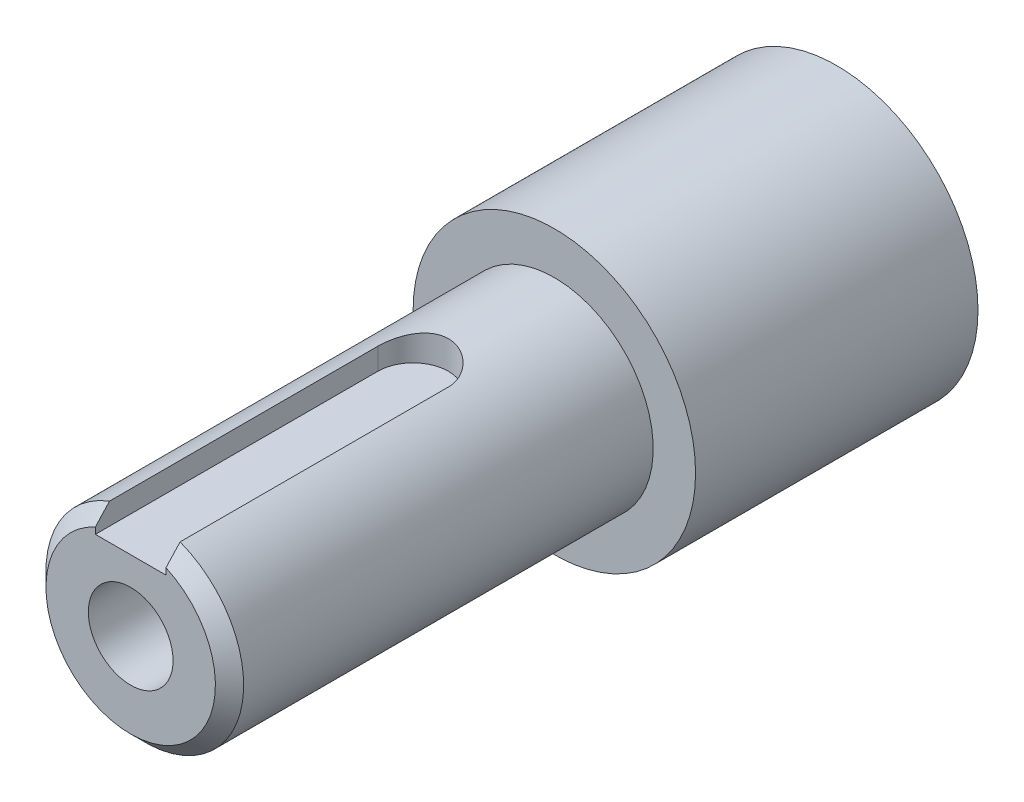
from build123d import *

# Parameters (mm, degrees)
ESQUISSE1_R                     = 7
EXTRUSION1_DEPTH                = 44
CHANFREIN1_SIZE                 = 1
ENL_V_MAT_EXTRU_1_DEPTH         = 2
TROU_TARAUD_M6X1_01_D           = 5
TROU_TARAUD_M6X1_01_DEPTH       = 25
TROU_TARAUD_M6X1_01_CBORE_D     = 6
TROU_TARAUD_M6X1_01_CBORE_DEPTH = 22
TROU_TARAUD_M6X1_01_TIP         = 1.502151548
EXTRUSION2_START                = -14
ESQUISSE7_R                     = 10
EXTRUSION2_DEPTH                = 20


with BuildPart() as part:
    # Esquisse1 → Extrusion1 (new body)
    with BuildSketch(Plane.XY):
        Circle(ESQUISSE1_R)
    extrude(amount=-EXTRUSION1_DEPTH)

    # Chanfrein1
    chanfrein1_edges = [part.edges().sort_by_distance(p)[0] for p in [
        (-7, 0, 0),
    ]]
    chamfer(chanfrein1_edges, length=CHANFREIN1_SIZE)

    # Esquisse3 → Enl_v. mat.-Extru.1 (cut)
    with BuildSketch(Plane(origin=(0, 7, 0), x_dir=(-1, 0, 0), z_dir=(0, 1, 0))):
        with BuildLine():
            Line((2.5, 0), (2.5, -20))
            ThreePointArc((2.5, -20), (0, -22.5), (-2.5, -20))
            Line((-2.5, -20), (-2.5, 0))
            Line((-2.5, 0), (2.5, 0))
        make_face()
    extrude(amount=-ENL_V_MAT_EXTRU_1_DEPTH, mode=Mode.SUBTRACT)

    # Trou taraud_ M6x1.01
    with Locations(Plane.XY):
        with Locations((0, 0)):
            CounterBoreHole(TROU_TARAUD_M6X1_01_D / 2, TROU_TARAUD_M6X1_01_CBORE_D / 2, TROU_TARAUD_M6X1_01_CBORE_DEPTH, depth=TROU_TARAUD_M6X1_01_DEPTH)
            with Locations((0, 0, -(TROU_TARAUD_M6X1_01_DEPTH + TROU_TARAUD_M6X1_01_TIP / 2))):  # 118° drill point
                Cone(0, TROU_TARAUD_M6X1_01_D / 2, TROU_TARAUD_M6X1_01_TIP, mode=Mode.SUBTRACT)

    # Esquisse7 → Extrusion2 (add)
    with BuildSketch(Plane(origin=(0, 0, -44), x_dir=(-1, 0, 0), z_dir=(0, 0, -1)).offset(EXTRUSION2_START)):
        Circle(ESQUISSE7_R)
    extrude(amount=EXTRUSION2_DEPTH)


solid = part.part
